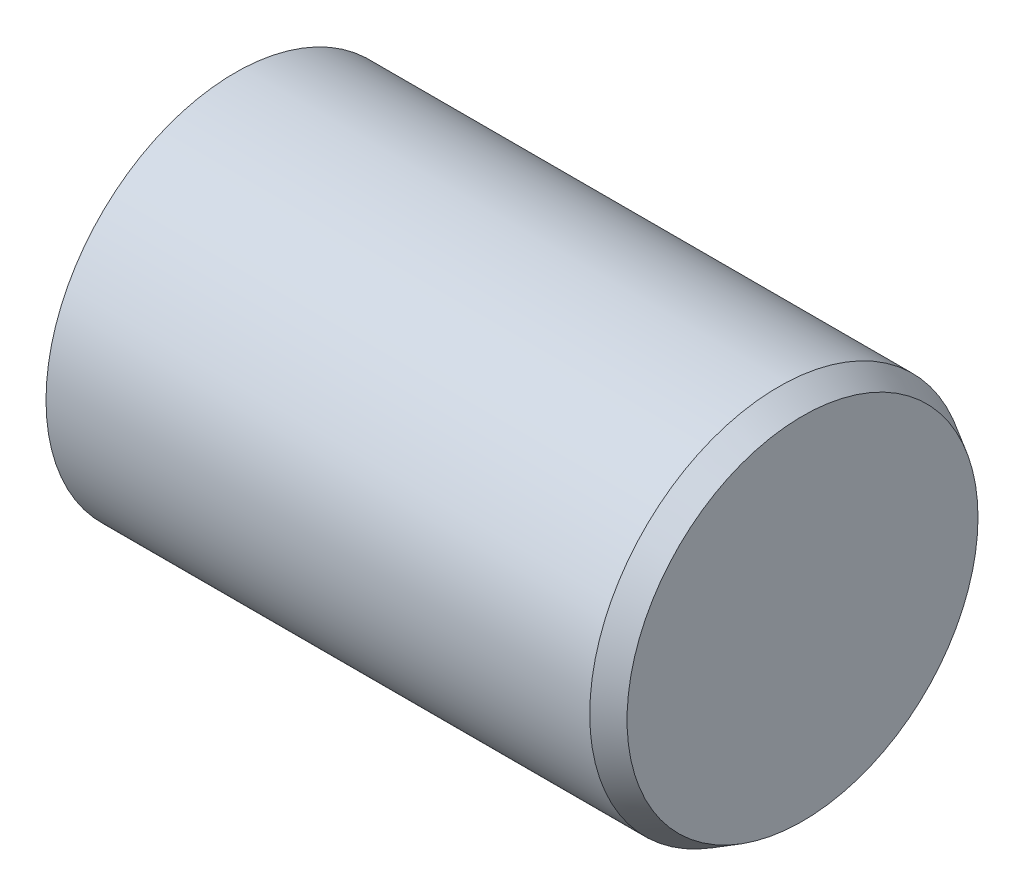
from build123d import *

# Parameters (mm, degrees)
ESQUISSE1_R               = 4
EXTRUSION1_DEPTH          = 12
CHANFREIN1_SIZE           = 0.5
CHANFREIN1_SIZE2          = 0.288675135
TROU_TARAUD_M4X0_71_D     = 3.3
TROU_TARAUD_M4X0_71_DEPTH = 8
TROU_TARAUD_M4X0_71_TIP   = 0.952627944


with BuildPart() as part:
    # Esquisse1 → Extrusion1 (new body)
    with BuildSketch(Plane(origin=(0, 0, 0), x_dir=(0, 0, -1), z_dir=(1, 0, 0))):
        Circle(ESQUISSE1_R)
    extrude(amount=EXTRUSION1_DEPTH)

    # Chanfrein1
    chanfrein1_edges = [part.edges().sort_by_distance(p)[0] for p in [
        (12, 0, 4),
    ]]
    chanfrein1_side = [part.faces().sort_by_distance(p)[0] for p in [
        (6, 0, 4),
    ]]
    chamfer(chanfrein1_edges, length=CHANFREIN1_SIZE, length2=CHANFREIN1_SIZE2, reference=chanfrein1_side[0])

    # Trou taraud_ M4x0.71
    with Locations(Plane.ZY):
        with Locations((0, 0)):
            Hole(TROU_TARAUD_M4X0_71_D / 2, depth=TROU_TARAUD_M4X0_71_DEPTH)
            with Locations((0, 0, -(TROU_TARAUD_M4X0_71_DEPTH + TROU_TARAUD_M4X0_71_TIP / 2))):  # 120° drill point
                Cone(0, TROU_TARAUD_M4X0_71_D / 2, TROU_TARAUD_M4X0_71_TIP, mode=Mode.SUBTRACT)


solid = part.part
